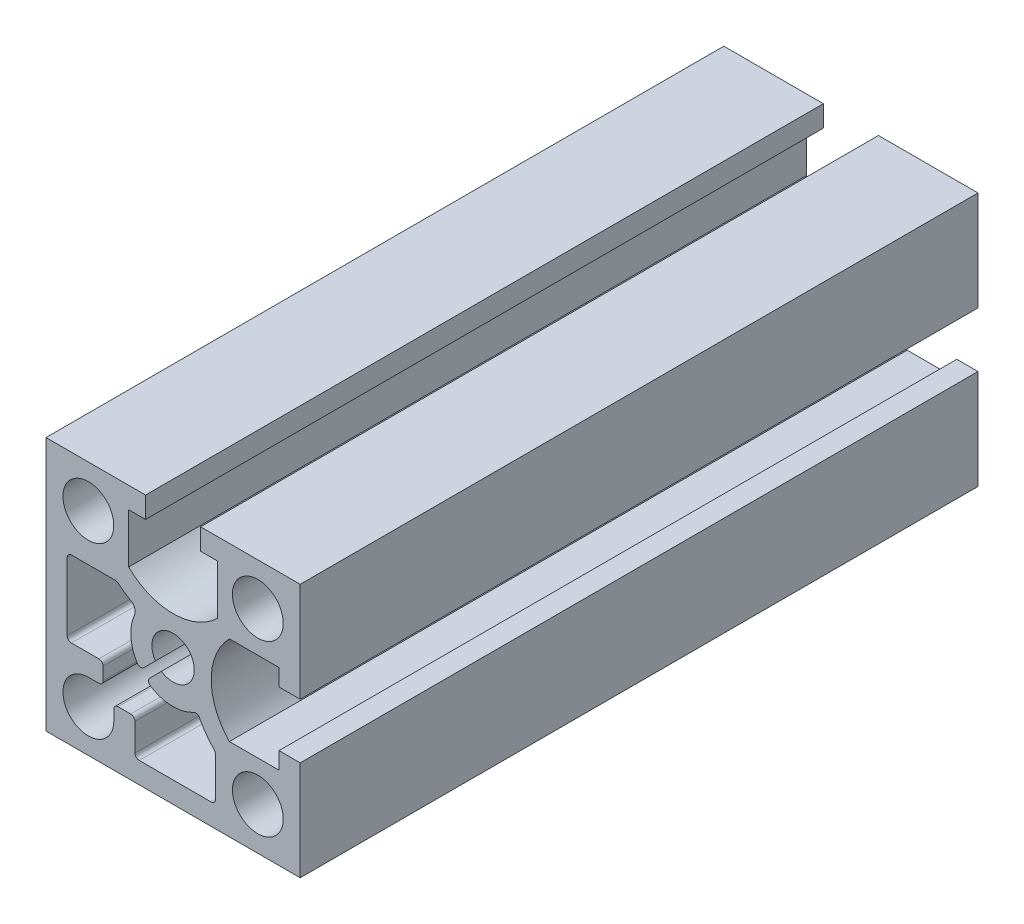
from build123d import *

# Parameters (mm, degrees)
SKETCH_1_R      = 3
EXTRUDE_1_DEPTH = 40


with BuildPart() as part:
    # Sketch 1 → Extrude 1 (new, symmetric)
    with BuildSketch(Plane.XY):
        with BuildLine():
            Line((-15, 15), (-3.25, 15))
            Line((-3.25, 15), (-3.25, 12.5))
            Line((-3.25, 12.5), (-5.25, 12.5))
            Line((-5.25, 12.5), (-5.25, 6.643928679))
            ThreePointArc((-5.25, 6.643928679), (0, 4.5), (5.25, 6.643928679))
            Line((5.25, 6.643928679), (5.25, 12.5))
            Line((5.25, 12.5), (3.25, 12.5))
            Line((3.25, 12.5), (3.25, 15))
            Line((3.25, 15), (15, 15))
            Line((15, 15), (15, 3.25))
            Line((15, 3.25), (12.5, 3.25))
            Line((12.5, 3.25), (12.5, 5.25))
            Line((12.5, 5.25), (6.643928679, 5.25))
            ThreePointArc((6.643928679, 5.25), (4.5, 0), (6.643928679, -5.25))
            Line((6.643928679, -5.25), (12.5, -5.25))
            Line((12.5, -5.25), (12.5, -3.25))
            Line((12.5, -3.25), (15, -3.25))
            Line((15, -3.25), (15, -15))
            Line((15, -15), (-15, -15))
            Line((-15, -15), (-15, 15))
        make_face()
        with Locations((10, 10)):
            Circle(SKETCH_1_R, mode=Mode.SUBTRACT)
        with Locations(Location((10, -10, 0), (0, 0, 180))):
            Circle(SKETCH_1_R, mode=Mode.SUBTRACT)
        with Locations(Location((-10, 10, 0), (0, 0, 180))):
            Circle(SKETCH_1_R, mode=Mode.SUBTRACT)
        with BuildLine():
            Line((-8.761903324, -4.5), (-12, -4.5))
            ThreePointArc((-12, -4.5), (-12.353553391, -4.353553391), (-12.5, -4))
            Line((-12.5, -4), (-12.5, 4))
            ThreePointArc((-12.5, 4), (-12.353553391, 4.353553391), (-12, 4.5))
            Line((-12, 4.5), (-6.800735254, 4.5))
            ThreePointArc((-6.800735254, 4.5), (-6.628218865, 4.469295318), (-6.476890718, 4.380952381))
            ThreePointArc((-6.476890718, 4.380952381), (-5.750545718, 3.818849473), (-4.975692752, 3.325757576))
            ThreePointArc((-4.975692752, 3.325757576), (-4.522133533, 2.767128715), (-4.56105169, 2.048611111))
            ThreePointArc((-4.56105169, 2.048611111), (-4.987902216, -0.347608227), (-4.23280577, -2.661457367))
            ThreePointArc((-4.23280577, -2.661457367), (-3.865431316, -2.892176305), (-3.455971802, -2.748865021))
            Line((-3.455971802, -2.748865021), (-2.085604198, -1.378497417))
            ThreePointArc((-2.085604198, -1.378497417), (1.767766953, 1.767766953), (-1.378497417, -2.085604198))
            Line((-1.378497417, -2.085604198), (-2.748865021, -3.455971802))
            ThreePointArc((-2.748865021, -3.455971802), (-2.892176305, -3.865431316), (-2.661457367, -4.23280577))
            ThreePointArc((-2.661457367, -4.23280577), (-0.13777044, -4.99810157), (2.424242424, -4.372990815))
            ThreePointArc((2.424242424, -4.372990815), (2.81173138, -4.331796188), (3.111111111, -4.581228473))
            ThreePointArc((3.111111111, -4.581228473), (3.893516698, -5.855333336), (4.857142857, -6.998542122))
            ThreePointArc((4.857142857, -6.998542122), (4.96291005, -7.159486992), (5, -7.348469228))
            Line((5, -7.348469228), (5, -12))
            ThreePointArc((5, -12), (4.853553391, -12.353553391), (4.5, -12.5))
            Line((4.5, -12.5), (-4, -12.5))
            ThreePointArc((-4, -12.5), (-4.353553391, -12.353553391), (-4.5, -12))
            Line((-4.5, -12), (-4.5, -8.761903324))
            ThreePointArc((-4.5, -8.761903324), (-4.646446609, -8.408349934), (-5, -8.261903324))
            Line((-5, -8.261903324), (-6.5, -8.261903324))
            ThreePointArc((-6.5, -8.261903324), (-6.853553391, -8.408349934), (-7, -8.761903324))
            Line((-7, -8.761903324), (-7, -10))
            ThreePointArc((-7, -10), (-12.121320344, -12.121320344), (-10, -7))
            Line((-10, -7), (-8.761903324, -7))
            ThreePointArc((-8.761903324, -7), (-8.408349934, -6.853553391), (-8.261903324, -6.5))
            Line((-8.261903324, -6.5), (-8.261903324, -5))
            ThreePointArc((-8.261903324, -5), (-8.408349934, -4.646446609), (-8.761903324, -4.5))
        make_face(mode=Mode.SUBTRACT)
    extrude(amount=EXTRUDE_1_DEPTH, both=True)


solid = part.part
